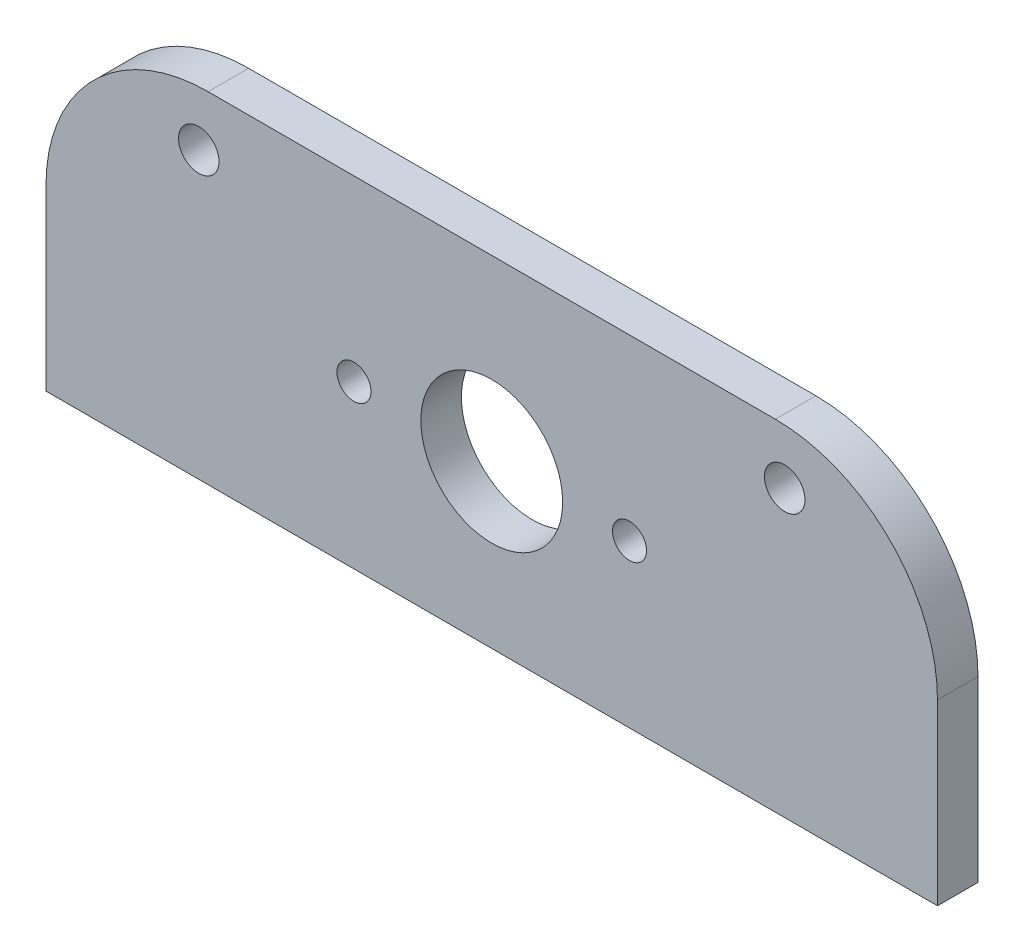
from build123d import *

# Parameters (mm, degrees)
ESQUISSE1_W                       = 110
ESQUISSE1_H                       = 42
ESQUISSE1_R                       = 8.75
ESQUISSE1_R_2                     = 2.5
BOSS_EXTRU_1_DEPTH                = 2.5
CONG_1_R                          = 20
DIAM_TRE_DU_PER_AGE_4_0_4_1_D     = 4
DIAM_TRE_DU_PER_AGE_4_0_4_1_DEPTH = 4
DIAM_TRE_DU_PER_AGE_4_0_4_1_TIP   = 1.201721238
TROU_TARAUD_M41_D                 = 3.3
TROU_TARAUD_M41_DEPTH             = 11.5
TROU_TARAUD_M41_TIP               = 0.991420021
TROU_TARAUD_M51_D                 = 4.2


with BuildPart() as part:
    # Esquisse1 → Boss.-Extru.1 (new, symmetric)
    with BuildSketch(Plane.XY):
        with Locations((0, 1)):
            Rectangle(ESQUISSE1_W, ESQUISSE1_H)
        Circle(ESQUISSE1_R, mode=Mode.SUBTRACT)
        with Locations((-36.15, 15.2)):
            Circle(ESQUISSE1_R_2, mode=Mode.SUBTRACT)
        with Locations((36.15, 15.2)):
            Circle(ESQUISSE1_R_2, mode=Mode.SUBTRACT)
    extrude(amount=BOSS_EXTRU_1_DEPTH, both=True)

    # Cong_1
    cong_1_edges = [part.edges().sort_by_distance(p)[0] for p in [
        (-55, 22, 0),
        (55, 22, 0),
    ]]
    fillet(cong_1_edges, radius=CONG_1_R)

    # Diam_tre du per_age _4.0 _4_1
    with Locations(Plane(origin=(0, -20, 0), x_dir=(-1, 0, 0), z_dir=(0, -1, 0))):
        with Locations((-20, 0), (20, 0)):
            Hole(DIAM_TRE_DU_PER_AGE_4_0_4_1_D / 2, depth=DIAM_TRE_DU_PER_AGE_4_0_4_1_DEPTH)
            with Locations((0, 0, -(DIAM_TRE_DU_PER_AGE_4_0_4_1_DEPTH + DIAM_TRE_DU_PER_AGE_4_0_4_1_TIP / 2))):  # 118° drill point
                Cone(0, DIAM_TRE_DU_PER_AGE_4_0_4_1_D / 2, DIAM_TRE_DU_PER_AGE_4_0_4_1_TIP, mode=Mode.SUBTRACT)

    # Trou taraud_ M41
    with Locations(Plane(origin=(0, -20, 0), x_dir=(-1, 0, 0), z_dir=(0, -1, 0))):
        with Locations((-33.5, 0), (33.5, 0)):
            Hole(TROU_TARAUD_M41_D / 2, depth=TROU_TARAUD_M41_DEPTH)
            with Locations((0, 0, -(TROU_TARAUD_M41_DEPTH + TROU_TARAUD_M41_TIP / 2))):  # 118° drill point
                Cone(0, TROU_TARAUD_M41_D / 2, TROU_TARAUD_M41_TIP, mode=Mode.SUBTRACT)

    # Trou taraud_ M51 (through all)
    with Locations(Plane.XY.offset(2.5)):
        with Locations((-17, 0), (17, 0)):
            Hole(TROU_TARAUD_M51_D / 2)


solid = part.part
